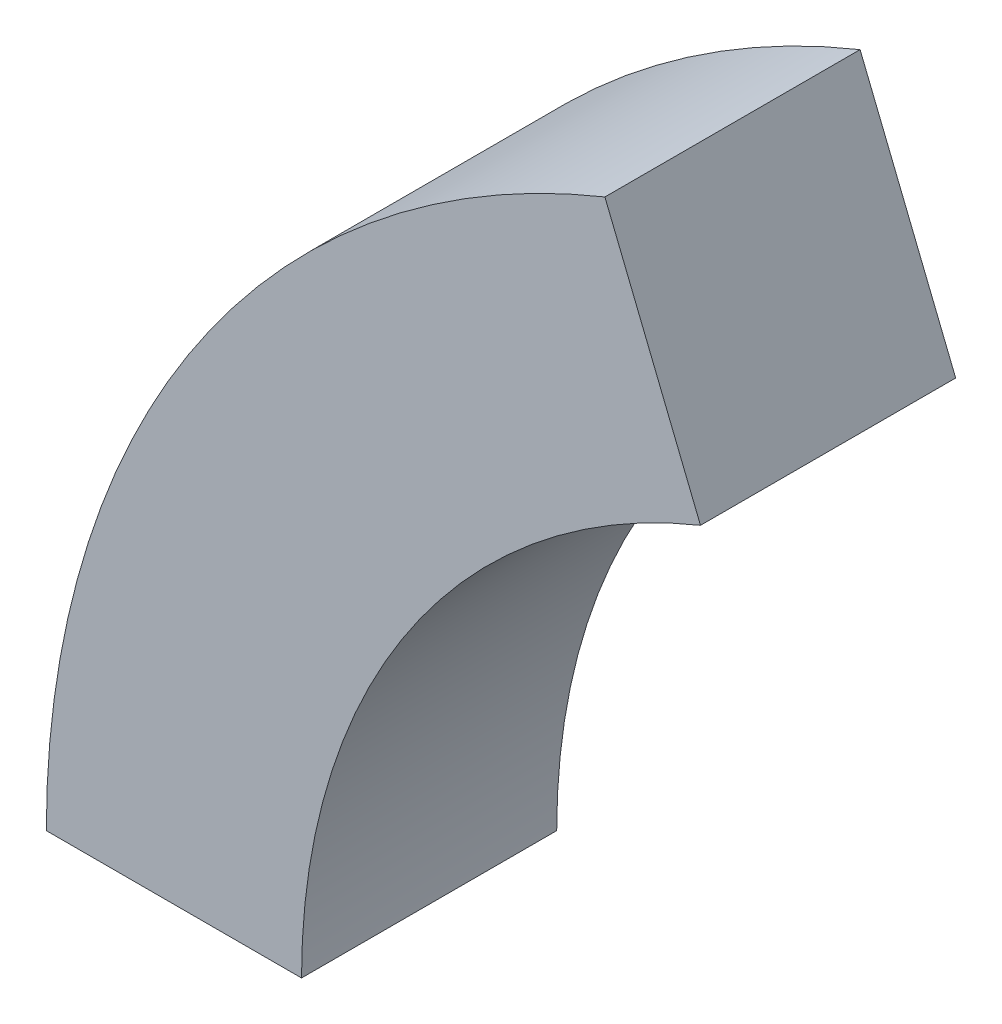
ISO-10303-21;
HEADER;
FILE_DESCRIPTION(('STEP AP214'),'2;1');
FILE_NAME('part.step','',(''),(''),'','','');
FILE_SCHEMA(('AUTOMOTIVE_DESIGN { 1 0 10303 214 1 1 1 1 }'));
ENDSEC;
DATA;
#1=APPLICATION_CONTEXT('core data for automotive mechanical design processes');
#2=APPLICATION_PROTOCOL_DEFINITION('international standard','automotive_design',2000,#1);
#3=PRODUCT_CONTEXT('',#1,'mechanical');
#4=PRODUCT('Part','Part','',(#3));
#5=PRODUCT_RELATED_PRODUCT_CATEGORY('part','',(#4));
#6=PRODUCT_DEFINITION_FORMATION('','',#4);
#7=PRODUCT_DEFINITION_CONTEXT('part definition',#1,'design');
#8=PRODUCT_DEFINITION('design','',#6,#7);
#9=PRODUCT_DEFINITION_SHAPE('','',#8);
#10=(LENGTH_UNIT() NAMED_UNIT(*) SI_UNIT(.MILLI.,.METRE.));
#11=(NAMED_UNIT(*) PLANE_ANGLE_UNIT() SI_UNIT($,.RADIAN.));
#12=(NAMED_UNIT(*) SI_UNIT($,.STERADIAN.) SOLID_ANGLE_UNIT());
#13=UNCERTAINTY_MEASURE_WITH_UNIT(LENGTH_MEASURE(1.E-05),#10,'distance_accuracy_value','');
#14=(GEOMETRIC_REPRESENTATION_CONTEXT(3) GLOBAL_UNCERTAINTY_ASSIGNED_CONTEXT((#13)) GLOBAL_UNIT_ASSIGNED_CONTEXT((#10,
#11,#12)) REPRESENTATION_CONTEXT('',''));
#15=CARTESIAN_POINT('',(0.,0.,0.));
#16=DIRECTION('',(0.,0.,1.));
#17=DIRECTION('',(1.,0.,0.));
#18=AXIS2_PLACEMENT_3D('',#15,#16,#17);
#19=CARTESIAN_POINT('',(35.,0.,0.));
#20=DIRECTION('',(0.,0.,1.));
#21=DIRECTION('',(1.,0.,0.));
#22=AXIS2_PLACEMENT_3D('',#19,#20,#21);
#23=CYLINDRICAL_SURFACE('',#22,49.);
#24=CARTESIAN_POINT('',(35.,0.,-14.));
#25=DIRECTION('',(0.,0.,1.));
#26=DIRECTION('',(1.,0.,0.));
#27=AXIS2_PLACEMENT_3D('',#24,#25,#26);
#28=CIRCLE('',#27,49.);
#29=CARTESIAN_POINT('',(16.6442769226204,45.4320088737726,-14.));
#30=VERTEX_POINT('',#29);
#31=CARTESIAN_POINT('',(-14.,0.,-14.));
#32=VERTEX_POINT('',#31);
#33=EDGE_CURVE('E11',#30,#32,#28,.T.);
#34=ORIENTED_EDGE('',*,*,#33,.T.);
#35=DIRECTION('',(0.,0.,1.));
#36=VECTOR('',#35,1.);
#37=CARTESIAN_POINT('',(-14.,0.,0.));
#38=LINE('',#37,#36);
#39=CARTESIAN_POINT('',(-14.,0.,0.));
#40=VERTEX_POINT('',#39);
#41=EDGE_CURVE('E90',#32,#40,#38,.T.);
#42=ORIENTED_EDGE('',*,*,#41,.T.);
#43=CARTESIAN_POINT('',(35.,0.,0.));
#44=DIRECTION('',(0.,0.,1.));
#45=DIRECTION('',(1.,0.,0.));
#46=AXIS2_PLACEMENT_3D('',#43,#44,#45);
#47=CIRCLE('',#46,49.);
#48=CARTESIAN_POINT('',(16.6442769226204,45.4320088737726,0.));
#49=VERTEX_POINT('',#48);
#50=EDGE_CURVE('E72',#49,#40,#47,.T.);
#51=ORIENTED_EDGE('',*,*,#50,.F.);
#52=DIRECTION('',(0.,0.,1.));
#53=VECTOR('',#52,1.);
#54=CARTESIAN_POINT('',(16.6442769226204,45.4320088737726,0.));
#55=LINE('',#54,#53);
#56=EDGE_CURVE('E98',#30,#49,#55,.T.);
#57=ORIENTED_EDGE('',*,*,#56,.F.);
#58=EDGE_LOOP('',(#34,#42,#51,#57));
#59=FACE_BOUND('',#58,.T.);
#60=ADVANCED_FACE('F32',(#59),#23,.T.);
#61=CARTESIAN_POINT('',(16.6442769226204,45.4320088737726,-14.));
#62=DIRECTION('',(0.,0.,1.));
#63=DIRECTION('',(1.,0.,0.));
#64=AXIS2_PLACEMENT_3D('',#61,#62,#63);
#65=PLANE('',#64);
#66=CARTESIAN_POINT('',(35.,0.,-14.));
#67=DIRECTION('',(0.,0.,1.));
#68=DIRECTION('',(1.,0.,0.));
#69=AXIS2_PLACEMENT_3D('',#66,#67,#68);
#70=CIRCLE('',#69,35.);
#71=CARTESIAN_POINT('',(21.8887692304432,32.4514349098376,-14.));
#72=VERTEX_POINT('',#71);
#73=CARTESIAN_POINT('',(0.,0.,-14.));
#74=VERTEX_POINT('',#73);
#75=EDGE_CURVE('E40',#72,#74,#70,.T.);
#76=ORIENTED_EDGE('',*,*,#75,.T.);
#77=DIRECTION('',(-1.,0.,0.));
#78=VECTOR('',#77,1.);
#79=CARTESIAN_POINT('',(-14.,0.,-14.));
#80=LINE('',#79,#78);
#81=EDGE_CURVE('E96',#74,#32,#80,.T.);
#82=ORIENTED_EDGE('',*,*,#81,.T.);
#83=ORIENTED_EDGE('',*,*,#33,.F.);
#84=DIRECTION('',(-0.37460659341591,0.927183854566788,0.));
#85=VECTOR('',#84,1.);
#86=CARTESIAN_POINT('',(16.6442769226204,45.4320088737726,-14.));
#87=LINE('',#86,#85);
#88=EDGE_CURVE('E84',#72,#30,#87,.T.);
#89=ORIENTED_EDGE('',*,*,#88,.F.);
#90=EDGE_LOOP('',(#76,#82,#83,#89));
#91=FACE_BOUND('',#90,.T.);
#92=ADVANCED_FACE('F34',(#91),#65,.F.);
#93=CARTESIAN_POINT('',(35.,0.,0.));
#94=DIRECTION('',(0.,0.,1.));
#95=DIRECTION('',(1.,0.,0.));
#96=AXIS2_PLACEMENT_3D('',#93,#94,#95);
#97=CYLINDRICAL_SURFACE('',#96,35.);
#98=CARTESIAN_POINT('',(35.,0.,0.));
#99=DIRECTION('',(0.,0.,1.));
#100=DIRECTION('',(1.,0.,0.));
#101=AXIS2_PLACEMENT_3D('',#98,#99,#100);
#102=CIRCLE('',#101,35.);
#103=CARTESIAN_POINT('',(21.8887692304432,32.4514349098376,0.));
#104=VERTEX_POINT('',#103);
#105=CARTESIAN_POINT('',(0.,0.,0.));
#106=VERTEX_POINT('',#105);
#107=EDGE_CURVE('E83',#104,#106,#102,.T.);
#108=ORIENTED_EDGE('',*,*,#107,.T.);
#109=DIRECTION('',(0.,0.,-1.));
#110=VECTOR('',#109,1.);
#111=CARTESIAN_POINT('',(0.,0.,0.));
#112=LINE('',#111,#110);
#113=EDGE_CURVE('E91',#106,#74,#112,.T.);
#114=ORIENTED_EDGE('',*,*,#113,.T.);
#115=ORIENTED_EDGE('',*,*,#75,.F.);
#116=DIRECTION('',(0.,0.,-1.));
#117=VECTOR('',#116,1.);
#118=CARTESIAN_POINT('',(21.8887692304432,32.4514349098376,0.));
#119=LINE('',#118,#117);
#120=EDGE_CURVE('E101',#104,#72,#119,.T.);
#121=ORIENTED_EDGE('',*,*,#120,.F.);
#122=EDGE_LOOP('',(#108,#114,#115,#121));
#123=FACE_BOUND('',#122,.T.);
#124=ADVANCED_FACE('F104',(#123),#97,.F.);
#125=CARTESIAN_POINT('',(16.6442769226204,45.4320088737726,0.));
#126=DIRECTION('',(0.,0.,-1.));
#127=DIRECTION('',(-1.,0.,0.));
#128=AXIS2_PLACEMENT_3D('',#125,#126,#127);
#129=PLANE('',#128);
#130=DIRECTION('',(0.37460659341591,-0.927183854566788,0.));
#131=VECTOR('',#130,1.);
#132=CARTESIAN_POINT('',(16.6442769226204,45.4320088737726,0.));
#133=LINE('',#132,#131);
#134=EDGE_CURVE('E78',#49,#104,#133,.T.);
#135=ORIENTED_EDGE('',*,*,#134,.F.);
#136=ORIENTED_EDGE('',*,*,#50,.T.);
#137=DIRECTION('',(1.,0.,0.));
#138=VECTOR('',#137,1.);
#139=CARTESIAN_POINT('',(-14.,0.,0.));
#140=LINE('',#139,#138);
#141=EDGE_CURVE('E75',#40,#106,#140,.T.);
#142=ORIENTED_EDGE('',*,*,#141,.T.);
#143=ORIENTED_EDGE('',*,*,#107,.F.);
#144=EDGE_LOOP('',(#135,#136,#142,#143));
#145=FACE_BOUND('',#144,.T.);
#146=ADVANCED_FACE('F74',(#145),#129,.F.);
#147=CARTESIAN_POINT('',(16.6442769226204,45.4320088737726,-14.));
#148=DIRECTION('',(-0.927183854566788,-0.37460659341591,0.));
#149=DIRECTION('',(0.,0.,-1.));
#150=AXIS2_PLACEMENT_3D('',#147,#148,#149);
#151=PLANE('',#150);
#152=ORIENTED_EDGE('',*,*,#56,.T.);
#153=ORIENTED_EDGE('',*,*,#134,.T.);
#154=ORIENTED_EDGE('',*,*,#120,.T.);
#155=ORIENTED_EDGE('',*,*,#88,.T.);
#156=EDGE_LOOP('',(#152,#153,#154,#155));
#157=FACE_BOUND('',#156,.T.);
#158=ADVANCED_FACE('F106',(#157),#151,.F.);
#159=CARTESIAN_POINT('',(-14.,0.,-14.));
#160=DIRECTION('',(0.,-1.,0.));
#161=DIRECTION('',(0.,0.,-1.));
#162=AXIS2_PLACEMENT_3D('',#159,#160,#161);
#163=PLANE('',#162);
#164=ORIENTED_EDGE('',*,*,#41,.F.);
#165=ORIENTED_EDGE('',*,*,#81,.F.);
#166=ORIENTED_EDGE('',*,*,#113,.F.);
#167=ORIENTED_EDGE('',*,*,#141,.F.);
#168=EDGE_LOOP('',(#164,#165,#166,#167));
#169=FACE_BOUND('',#168,.T.);
#170=ADVANCED_FACE('F88',(#169),#163,.T.);
#171=CLOSED_SHELL('',(#60,#92,#124,#146,#158,#170));
#172=MANIFOLD_SOLID_BREP('B2',#171);
#173=ADVANCED_BREP_SHAPE_REPRESENTATION('',(#18,#172),#14);
#174=SHAPE_DEFINITION_REPRESENTATION(#9,#173);
ENDSEC;
END-ISO-10303-21;
